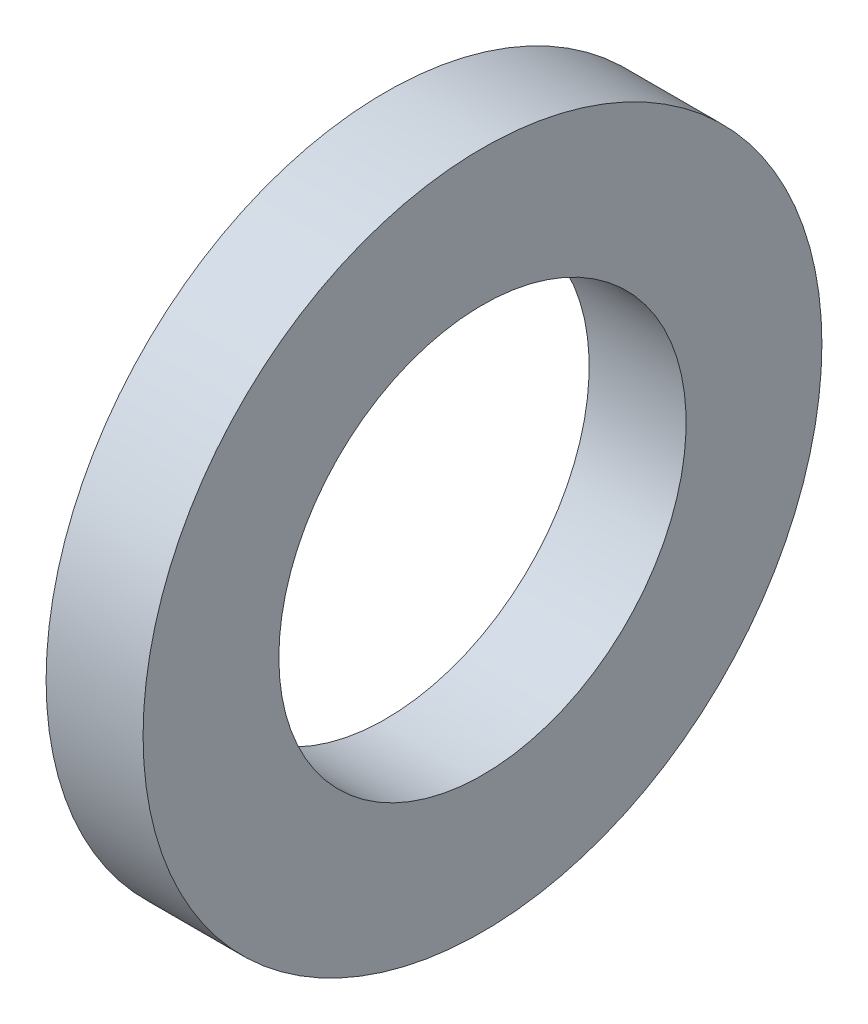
ISO-10303-21;
HEADER;
FILE_DESCRIPTION(('STEP AP214'),'2;1');
FILE_NAME('part.step','',(''),(''),'','','');
FILE_SCHEMA(('AUTOMOTIVE_DESIGN { 1 0 10303 214 1 1 1 1 }'));
ENDSEC;
DATA;
#1=APPLICATION_CONTEXT('core data for automotive mechanical design processes');
#2=APPLICATION_PROTOCOL_DEFINITION('international standard','automotive_design',2000,#1);
#3=PRODUCT_CONTEXT('',#1,'mechanical');
#4=PRODUCT('Part','Part','',(#3));
#5=PRODUCT_RELATED_PRODUCT_CATEGORY('part','',(#4));
#6=PRODUCT_DEFINITION_FORMATION('','',#4);
#7=PRODUCT_DEFINITION_CONTEXT('part definition',#1,'design');
#8=PRODUCT_DEFINITION('design','',#6,#7);
#9=PRODUCT_DEFINITION_SHAPE('','',#8);
#10=(LENGTH_UNIT() NAMED_UNIT(*) SI_UNIT(.MILLI.,.METRE.));
#11=(NAMED_UNIT(*) PLANE_ANGLE_UNIT() SI_UNIT($,.RADIAN.));
#12=(NAMED_UNIT(*) SI_UNIT($,.STERADIAN.) SOLID_ANGLE_UNIT());
#13=UNCERTAINTY_MEASURE_WITH_UNIT(LENGTH_MEASURE(1.E-05),#10,'distance_accuracy_value','');
#14=(GEOMETRIC_REPRESENTATION_CONTEXT(3) GLOBAL_UNCERTAINTY_ASSIGNED_CONTEXT((#13)) GLOBAL_UNIT_ASSIGNED_CONTEXT((#10,
#11,#12)) REPRESENTATION_CONTEXT('',''));
#15=CARTESIAN_POINT('',(0.,0.,0.));
#16=DIRECTION('',(0.,0.,1.));
#17=DIRECTION('',(1.,0.,0.));
#18=AXIS2_PLACEMENT_3D('',#15,#16,#17);
#19=CARTESIAN_POINT('',(0.,0.,-7.));
#20=DIRECTION('',(1.,0.,0.));
#21=DIRECTION('',(0.,0.,-1.));
#22=AXIS2_PLACEMENT_3D('',#19,#20,#21);
#23=PLANE('',#22);
#24=CARTESIAN_POINT('',(0.,0.,0.));
#25=DIRECTION('',(-1.,0.,0.));
#26=DIRECTION('',(0.,0.,1.));
#27=AXIS2_PLACEMENT_3D('',#24,#25,#26);
#28=CIRCLE('',#27,4.2);
#29=CARTESIAN_POINT('',(0.,0.,4.2));
#30=VERTEX_POINT('',#29);
#31=EDGE_CURVE('E10',#30,#30,#28,.T.);
#32=ORIENTED_EDGE('',*,*,#31,.F.);
#33=EDGE_LOOP('',(#32));
#34=FACE_BOUND('',#33,.T.);
#35=CARTESIAN_POINT('',(0.,0.,0.));
#36=DIRECTION('',(-1.,0.,0.));
#37=DIRECTION('',(0.,0.,1.));
#38=AXIS2_PLACEMENT_3D('',#35,#36,#37);
#39=CIRCLE('',#38,7.);
#40=CARTESIAN_POINT('',(0.,0.,7.));
#41=VERTEX_POINT('',#40);
#42=EDGE_CURVE('E44',#41,#41,#39,.T.);
#43=ORIENTED_EDGE('',*,*,#42,.T.);
#44=EDGE_LOOP('',(#43));
#45=FACE_BOUND('',#44,.T.);
#46=ADVANCED_FACE('F30',(#34,#45),#23,.F.);
#47=CARTESIAN_POINT('',(0.,0.,0.));
#48=DIRECTION('',(-1.,0.,0.));
#49=DIRECTION('',(0.,0.,1.));
#50=AXIS2_PLACEMENT_3D('',#47,#48,#49);
#51=CYLINDRICAL_SURFACE('',#50,4.2);
#52=CARTESIAN_POINT('',(2.,0.,0.));
#53=DIRECTION('',(-1.,0.,0.));
#54=DIRECTION('',(0.,0.,1.));
#55=AXIS2_PLACEMENT_3D('',#52,#53,#54);
#56=CIRCLE('',#55,4.2);
#57=CARTESIAN_POINT('',(2.,0.,4.2));
#58=VERTEX_POINT('',#57);
#59=EDGE_CURVE('E36',#58,#58,#56,.T.);
#60=ORIENTED_EDGE('',*,*,#59,.F.);
#61=EDGE_LOOP('',(#60));
#62=FACE_BOUND('',#61,.T.);
#63=ORIENTED_EDGE('',*,*,#31,.T.);
#64=EDGE_LOOP('',(#63));
#65=FACE_BOUND('',#64,.T.);
#66=ADVANCED_FACE('F59',(#62,#65),#51,.F.);
#67=CARTESIAN_POINT('',(2.,0.,-7.));
#68=DIRECTION('',(-1.,0.,0.));
#69=DIRECTION('',(0.,0.,1.));
#70=AXIS2_PLACEMENT_3D('',#67,#68,#69);
#71=PLANE('',#70);
#72=CARTESIAN_POINT('',(2.,0.,0.));
#73=DIRECTION('',(-1.,0.,0.));
#74=DIRECTION('',(0.,0.,1.));
#75=AXIS2_PLACEMENT_3D('',#72,#73,#74);
#76=CIRCLE('',#75,7.);
#77=CARTESIAN_POINT('',(2.,0.,7.));
#78=VERTEX_POINT('',#77);
#79=EDGE_CURVE('E40',#78,#78,#76,.T.);
#80=ORIENTED_EDGE('',*,*,#79,.F.);
#81=EDGE_LOOP('',(#80));
#82=FACE_BOUND('',#81,.T.);
#83=ORIENTED_EDGE('',*,*,#59,.T.);
#84=EDGE_LOOP('',(#83));
#85=FACE_BOUND('',#84,.T.);
#86=ADVANCED_FACE('F54',(#82,#85),#71,.F.);
#87=CARTESIAN_POINT('',(0.,0.,0.));
#88=DIRECTION('',(-1.,0.,0.));
#89=DIRECTION('',(0.,0.,1.));
#90=AXIS2_PLACEMENT_3D('',#87,#88,#89);
#91=CYLINDRICAL_SURFACE('',#90,7.);
#92=ORIENTED_EDGE('',*,*,#42,.F.);
#93=EDGE_LOOP('',(#92));
#94=FACE_BOUND('',#93,.T.);
#95=ORIENTED_EDGE('',*,*,#79,.T.);
#96=EDGE_LOOP('',(#95));
#97=FACE_BOUND('',#96,.T.);
#98=ADVANCED_FACE('F51',(#94,#97),#91,.T.);
#99=CLOSED_SHELL('',(#46,#66,#86,#98));
#100=MANIFOLD_SOLID_BREP('B2',#99);
#101=ADVANCED_BREP_SHAPE_REPRESENTATION('',(#18,#100),#14);
#102=SHAPE_DEFINITION_REPRESENTATION(#9,#101);
ENDSEC;
END-ISO-10303-21;
